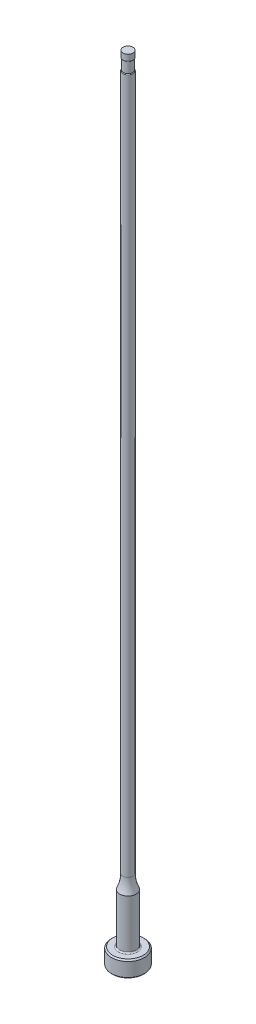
ISO-10303-21;
HEADER;
FILE_DESCRIPTION(('STEP AP214'),'2;1');
FILE_NAME('part.step','',(''),(''),'','','');
FILE_SCHEMA(('AUTOMOTIVE_DESIGN { 1 0 10303 214 1 1 1 1 }'));
ENDSEC;
DATA;
#1=APPLICATION_CONTEXT('core data for automotive mechanical design processes');
#2=APPLICATION_PROTOCOL_DEFINITION('international standard','automotive_design',2000,#1);
#3=PRODUCT_CONTEXT('',#1,'mechanical');
#4=PRODUCT('Part','Part','',(#3));
#5=PRODUCT_RELATED_PRODUCT_CATEGORY('part','',(#4));
#6=PRODUCT_DEFINITION_FORMATION('','',#4);
#7=PRODUCT_DEFINITION_CONTEXT('part definition',#1,'design');
#8=PRODUCT_DEFINITION('design','',#6,#7);
#9=PRODUCT_DEFINITION_SHAPE('','',#8);
#10=(LENGTH_UNIT() NAMED_UNIT(*) SI_UNIT(.MILLI.,.METRE.));
#11=(NAMED_UNIT(*) PLANE_ANGLE_UNIT() SI_UNIT($,.RADIAN.));
#12=(NAMED_UNIT(*) SI_UNIT($,.STERADIAN.) SOLID_ANGLE_UNIT());
#13=UNCERTAINTY_MEASURE_WITH_UNIT(LENGTH_MEASURE(1.E-05),#10,'distance_accuracy_value','');
#14=(GEOMETRIC_REPRESENTATION_CONTEXT(3) GLOBAL_UNCERTAINTY_ASSIGNED_CONTEXT((#13)) GLOBAL_UNIT_ASSIGNED_CONTEXT((#10,
#11,#12)) REPRESENTATION_CONTEXT('',''));
#15=CARTESIAN_POINT('',(0.,0.,0.));
#16=DIRECTION('',(0.,0.,1.));
#17=DIRECTION('',(1.,0.,0.));
#18=AXIS2_PLACEMENT_3D('',#15,#16,#17);
#19=CARTESIAN_POINT('',(0.,259.958771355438,0.));
#20=DIRECTION('',(0.,1.,0.));
#21=DIRECTION('',(0.,0.,1.));
#22=AXIS2_PLACEMENT_3D('',#19,#20,#21);
#23=CYLINDRICAL_SURFACE('',#22,0.991869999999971);
#24=DIRECTION('',(0.,1.,0.));
#25=VECTOR('',#24,1.);
#26=CARTESIAN_POINT('',(-0.890269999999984,259.958771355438,-0.437293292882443));
#27=LINE('',#26,#25);
#28=CARTESIAN_POINT('',(-0.890269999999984,148.973565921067,-0.437293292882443));
#29=VERTEX_POINT('',#28);
#30=CARTESIAN_POINT('',(-0.890269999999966,112.014,-0.43729329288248));
#31=VERTEX_POINT('',#30);
#32=EDGE_CURVE('E66',#29,#31,#27,.F.);
#33=ORIENTED_EDGE('',*,*,#32,.F.);
#34=CARTESIAN_POINT('',(0.,148.973565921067,0.));
#35=DIRECTION('',(0.,1.,0.));
#36=DIRECTION('',(0.,0.,1.));
#37=AXIS2_PLACEMENT_3D('',#34,#35,#36);
#38=CIRCLE('',#37,0.991869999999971);
#39=CARTESIAN_POINT('',(-0.890269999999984,148.973565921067,0.437293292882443));
#40=VERTEX_POINT('',#39);
#41=EDGE_CURVE('E44',#29,#40,#38,.F.);
#42=ORIENTED_EDGE('',*,*,#41,.T.);
#43=DIRECTION('',(0.,1.,0.));
#44=VECTOR('',#43,1.);
#45=CARTESIAN_POINT('',(-0.890269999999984,259.958771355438,0.437293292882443));
#46=LINE('',#45,#44);
#47=CARTESIAN_POINT('',(-0.890269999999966,112.014,0.43729329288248));
#48=VERTEX_POINT('',#47);
#49=EDGE_CURVE('E72',#48,#40,#46,.T.);
#50=ORIENTED_EDGE('',*,*,#49,.F.);
#51=CARTESIAN_POINT('',(-0.890269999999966,112.014,-0.437293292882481));
#52=CARTESIAN_POINT('',(-0.890266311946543,111.980545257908,-0.437278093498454));
#53=CARTESIAN_POINT('',(-0.890798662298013,111.947083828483,-0.436215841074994));
#54=CARTESIAN_POINT('',(-0.89291221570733,111.8802670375,-0.431885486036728));
#55=CARTESIAN_POINT('',(-0.894495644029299,111.846912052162,-0.428612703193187));
#56=CARTESIAN_POINT('',(-0.898710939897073,111.780207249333,-0.419700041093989));
#57=CARTESIAN_POINT('',(-0.901354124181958,111.7468615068,-0.414034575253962));
#58=CARTESIAN_POINT('',(-0.907624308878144,111.680839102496,-0.400103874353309));
#59=CARTESIAN_POINT('',(-0.911250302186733,111.648161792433,-0.391841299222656));
#60=CARTESIAN_POINT('',(-0.919626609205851,111.581872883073,-0.371778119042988));
#61=CARTESIAN_POINT('',(-0.924431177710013,111.54832221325,-0.359795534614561));
#62=CARTESIAN_POINT('',(-0.934806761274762,111.48304822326,-0.331911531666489));
#63=CARTESIAN_POINT('',(-0.940375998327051,111.451320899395,-0.316019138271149));
#64=CARTESIAN_POINT('',(-0.950464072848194,111.398247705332,-0.283956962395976));
#65=CARTESIAN_POINT('',(-0.954903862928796,111.376269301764,-0.268819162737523));
#66=CARTESIAN_POINT('',(-0.963691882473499,111.334821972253,-0.235377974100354));
#67=CARTESIAN_POINT('',(-0.968040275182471,111.315348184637,-0.217080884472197));
#68=CARTESIAN_POINT('',(-0.974794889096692,111.286172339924,-0.183749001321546));
#69=CARTESIAN_POINT('',(-0.977361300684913,111.275390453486,-0.169697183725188));
#70=CARTESIAN_POINT('',(-0.982046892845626,111.256069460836,-0.140050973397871));
#71=CARTESIAN_POINT('',(-0.98416667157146,111.247527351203,-0.124458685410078));
#72=CARTESIAN_POINT('',(-0.987438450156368,111.234502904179,-0.0946420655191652));
#73=CARTESIAN_POINT('',(-0.988692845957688,111.229581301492,-0.080622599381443));
#74=CARTESIAN_POINT('',(-0.990613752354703,111.222085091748,-0.0519284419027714));
#75=CARTESIAN_POINT('',(-0.991280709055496,111.219508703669,-0.0372542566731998));
#76=CARTESIAN_POINT('',(-0.991951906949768,111.21691599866,-0.00760975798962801));
#77=CARTESIAN_POINT('',(-0.99195380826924,111.216908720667,0.00736141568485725));
#78=CARTESIAN_POINT('',(-0.991288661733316,111.219477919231,0.0370648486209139));
#79=CARTESIAN_POINT('',(-0.99062142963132,111.222055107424,0.0517970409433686));
#80=CARTESIAN_POINT('',(-0.988743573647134,111.229383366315,0.0798806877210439));
#81=CARTESIAN_POINT('',(-0.987561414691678,111.234020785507,0.0932643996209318));
#82=CARTESIAN_POINT('',(-0.984768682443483,111.245124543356,0.119193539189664));
#83=CARTESIAN_POINT('',(-0.983157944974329,111.251591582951,0.131738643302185));
#84=CARTESIAN_POINT('',(-0.97866177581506,111.269953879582,0.162424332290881));
#85=CARTESIAN_POINT('',(-0.975558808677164,111.282890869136,0.179909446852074));
#86=CARTESIAN_POINT('',(-0.968967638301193,111.31132520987,0.212571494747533));
#87=CARTESIAN_POINT('',(-0.965478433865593,111.326829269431,0.227742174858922));
#88=CARTESIAN_POINT('',(-0.956293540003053,111.369332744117,0.264288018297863));
#89=CARTESIAN_POINT('',(-0.950512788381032,111.397709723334,0.284029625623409));
#90=CARTESIAN_POINT('',(-0.939335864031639,111.457144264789,0.319042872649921));
#91=CARTESIAN_POINT('',(-0.933940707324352,111.488208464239,0.334303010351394));
#92=CARTESIAN_POINT('',(-0.920397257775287,111.574246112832,0.370513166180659));
#93=CARTESIAN_POINT('',(-0.91295453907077,111.630778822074,0.388004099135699));
#94=CARTESIAN_POINT('',(-0.901068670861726,111.745979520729,0.414830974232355));
#95=CARTESIAN_POINT('',(-0.896628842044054,111.804649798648,0.424157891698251));
#96=CARTESIAN_POINT('',(-0.892643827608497,111.888710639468,0.432432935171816));
#97=CARTESIAN_POINT('',(-0.891752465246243,111.913788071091,0.434264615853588));
#98=CARTESIAN_POINT('',(-0.890566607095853,111.963908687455,0.436690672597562));
#99=CARTESIAN_POINT('',(-0.890269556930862,111.988951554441,0.437290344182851));
#100=CARTESIAN_POINT('',(-0.890269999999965,112.014,0.437293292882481));
#101=B_SPLINE_CURVE_WITH_KNOTS('',3,(#51,#52,#53,#54,#55,#56,#57,#58,#59,#60,#61,#62,#63,#64,
#65,#66,#67,#68,#69,#70,#71,#72,#73,#74,#75,#76,#77,#78,#79,#80,#81,#82,#83,#84,#85,#86,#87,#88,
#89,#90,#91,#92,#93,#94,#95,#96,#97,#98,#99,#100),.UNSPECIFIED.,.F.,.F.,(4,2,2,2,2,2,2,2,2,2,2,
2,2,2,2,2,2,2,2,2,2,2,2,2,4),(0.,0.10035396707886,0.200921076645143,0.302591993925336,
0.404159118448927,0.511798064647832,0.619190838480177,0.700138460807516,0.780926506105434,
0.834449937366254,0.887901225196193,0.932447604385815,0.976960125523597,1.02162925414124,
1.06631068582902,1.10878536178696,1.15127633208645,1.21681290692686,1.28252352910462,
1.38707795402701,1.49189842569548,1.66985552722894,1.84800909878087,1.92345875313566,
1.99858341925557),.UNSPECIFIED.);
#102=EDGE_CURVE('E74',#31,#48,#101,.T.);
#103=ORIENTED_EDGE('',*,*,#102,.F.);
#104=EDGE_LOOP('',(#33,#42,#50,#103));
#105=FACE_BOUND('',#104,.T.);
#106=CARTESIAN_POINT('',(0.,15.3850932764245,0.));
#107=DIRECTION('',(0.,1.,0.));
#108=DIRECTION('',(0.,0.,1.));
#109=AXIS2_PLACEMENT_3D('',#106,#107,#108);
#110=CIRCLE('',#109,0.991869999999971);
#111=CARTESIAN_POINT('',(0.,15.3850932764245,0.991869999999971));
#112=VERTEX_POINT('',#111);
#113=EDGE_CURVE('E95',#112,#112,#110,.T.);
#114=ORIENTED_EDGE('',*,*,#113,.T.);
#115=EDGE_LOOP('',(#114));
#116=FACE_BOUND('',#115,.T.);
#117=ADVANCED_FACE('F36',(#105,#116),#23,.T.);
#118=CARTESIAN_POINT('',(0.,15.3850932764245,0.));
#119=DIRECTION('',(0.,1.,0.));
#120=DIRECTION('',(0.,0.,1.));
#121=AXIS2_PLACEMENT_3D('',#118,#119,#120);
#122=TOROIDAL_SURFACE('',#121,7.34186999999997,6.35);
#123=CARTESIAN_POINT('',(0.,12.7,0.));
#124=DIRECTION('',(0.,1.,0.));
#125=DIRECTION('',(0.,0.,1.));
#126=AXIS2_PLACEMENT_3D('',#123,#124,#125);
#127=CIRCLE('',#126,1.58749999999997);
#128=CARTESIAN_POINT('',(0.,12.7,1.58749999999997));
#129=VERTEX_POINT('',#128);
#130=EDGE_CURVE('E92',#129,#129,#127,.T.);
#131=ORIENTED_EDGE('',*,*,#130,.T.);
#132=EDGE_LOOP('',(#131));
#133=FACE_BOUND('',#132,.T.);
#134=ORIENTED_EDGE('',*,*,#113,.F.);
#135=EDGE_LOOP('',(#134));
#136=FACE_BOUND('',#135,.T.);
#137=ADVANCED_FACE('F156',(#133,#136),#122,.F.);
#138=CARTESIAN_POINT('',(0.,259.958771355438,0.));
#139=DIRECTION('',(0.,1.,0.));
#140=DIRECTION('',(0.,0.,1.));
#141=AXIS2_PLACEMENT_3D('',#138,#139,#140);
#142=CYLINDRICAL_SURFACE('',#141,1.58749999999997);
#143=CARTESIAN_POINT('',(0.,3.42900000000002,0.));
#144=DIRECTION('',(0.,1.,0.));
#145=DIRECTION('',(0.,0.,1.));
#146=AXIS2_PLACEMENT_3D('',#143,#144,#145);
#147=CIRCLE('',#146,1.58749999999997);
#148=CARTESIAN_POINT('',(0.,3.42900000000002,1.58749999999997));
#149=VERTEX_POINT('',#148);
#150=EDGE_CURVE('E110',#149,#149,#147,.T.);
#151=ORIENTED_EDGE('',*,*,#150,.T.);
#152=EDGE_LOOP('',(#151));
#153=FACE_BOUND('',#152,.T.);
#154=ORIENTED_EDGE('',*,*,#130,.F.);
#155=EDGE_LOOP('',(#154));
#156=FACE_BOUND('',#155,.T.);
#157=ADVANCED_FACE('F153',(#153,#156),#142,.T.);
#158=CARTESIAN_POINT('',(-3.17499999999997,3.175,0.));
#159=DIRECTION('',(0.,1.,0.));
#160=DIRECTION('',(0.,0.,1.));
#161=AXIS2_PLACEMENT_3D('',#158,#159,#160);
#162=PLANE('',#161);
#163=CARTESIAN_POINT('',(0.,3.175,0.));
#164=DIRECTION('',(0.,1.,0.));
#165=DIRECTION('',(0.,0.,1.));
#166=AXIS2_PLACEMENT_3D('',#163,#164,#165);
#167=CIRCLE('',#166,1.84149999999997);
#168=CARTESIAN_POINT('',(0.,3.175,1.84149999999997));
#169=VERTEX_POINT('',#168);
#170=EDGE_CURVE('E78',#169,#169,#167,.F.);
#171=ORIENTED_EDGE('',*,*,#170,.T.);
#172=EDGE_LOOP('',(#171));
#173=FACE_BOUND('',#172,.T.);
#174=CARTESIAN_POINT('',(0.,3.175,0.));
#175=DIRECTION('',(0.,1.,0.));
#176=DIRECTION('',(0.,0.,1.));
#177=AXIS2_PLACEMENT_3D('',#174,#175,#176);
#178=CIRCLE('',#177,2.92099999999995);
#179=CARTESIAN_POINT('',(0.,3.175,2.92099999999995));
#180=VERTEX_POINT('',#179);
#181=EDGE_CURVE('E98',#180,#180,#178,.T.);
#182=ORIENTED_EDGE('',*,*,#181,.T.);
#183=EDGE_LOOP('',(#182));
#184=FACE_BOUND('',#183,.T.);
#185=ADVANCED_FACE('F149',(#173,#184),#162,.T.);
#186=CARTESIAN_POINT('',(0.,259.958771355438,0.));
#187=DIRECTION('',(0.,1.,0.));
#188=DIRECTION('',(0.,0.,1.));
#189=AXIS2_PLACEMENT_3D('',#186,#187,#188);
#190=CYLINDRICAL_SURFACE('',#189,3.17499999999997);
#191=CARTESIAN_POINT('',(0.,2.92100000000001,0.));
#192=DIRECTION('',(0.,1.,0.));
#193=DIRECTION('',(0.,0.,1.));
#194=AXIS2_PLACEMENT_3D('',#191,#192,#193);
#195=CIRCLE('',#194,3.17499999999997);
#196=CARTESIAN_POINT('',(0.,2.92100000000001,3.17499999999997));
#197=VERTEX_POINT('',#196);
#198=EDGE_CURVE('E104',#197,#197,#195,.F.);
#199=ORIENTED_EDGE('',*,*,#198,.T.);
#200=EDGE_LOOP('',(#199));
#201=FACE_BOUND('',#200,.T.);
#202=CARTESIAN_POINT('',(0.,0.254000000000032,0.));
#203=DIRECTION('',(0.,-1.,0.));
#204=DIRECTION('',(0.,0.,-1.));
#205=AXIS2_PLACEMENT_3D('',#202,#203,#204);
#206=CIRCLE('',#205,3.17499999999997);
#207=CARTESIAN_POINT('',(0.,0.254000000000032,-3.17499999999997));
#208=VERTEX_POINT('',#207);
#209=EDGE_CURVE('E101',#208,#208,#206,.F.);
#210=ORIENTED_EDGE('',*,*,#209,.T.);
#211=EDGE_LOOP('',(#210));
#212=FACE_BOUND('',#211,.T.);
#213=ADVANCED_FACE('F145',(#201,#212),#190,.T.);
#214=CARTESIAN_POINT('',(0.,0.,0.));
#215=DIRECTION('',(0.,-1.,0.));
#216=DIRECTION('',(0.,0.,-1.));
#217=AXIS2_PLACEMENT_3D('',#214,#215,#216);
#218=PLANE('',#217);
#219=CARTESIAN_POINT('',(0.,0.,0.));
#220=DIRECTION('',(0.,-1.,0.));
#221=DIRECTION('',(0.,0.,-1.));
#222=AXIS2_PLACEMENT_3D('',#219,#220,#221);
#223=CIRCLE('',#222,2.92099999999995);
#224=CARTESIAN_POINT('',(0.,0.,-2.92099999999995));
#225=VERTEX_POINT('',#224);
#226=EDGE_CURVE('E107',#225,#225,#223,.T.);
#227=ORIENTED_EDGE('',*,*,#226,.T.);
#228=EDGE_LOOP('',(#227));
#229=FACE_BOUND('',#228,.T.);
#230=ADVANCED_FACE('F141',(#229),#218,.T.);
#231=CARTESIAN_POINT('',(0.,3.17499999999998,0.));
#232=DIRECTION('',(0.,-1.,0.));
#233=DIRECTION('',(0.,0.,-1.));
#234=AXIS2_PLACEMENT_3D('',#231,#232,#233);
#235=CONICAL_SURFACE('',#234,2.92099999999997,0.7853981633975);
#236=ORIENTED_EDGE('',*,*,#198,.F.);
#237=EDGE_LOOP('',(#236));
#238=FACE_BOUND('',#237,.T.);
#239=ORIENTED_EDGE('',*,*,#181,.F.);
#240=EDGE_LOOP('',(#239));
#241=FACE_BOUND('',#240,.T.);
#242=ADVANCED_FACE('F144',(#238,#241),#235,.T.);
#243=CARTESIAN_POINT('',(0.,0.254000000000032,0.));
#244=DIRECTION('',(0.,1.,0.));
#245=DIRECTION('',(0.,0.,1.));
#246=AXIS2_PLACEMENT_3D('',#243,#244,#245);
#247=CONICAL_SURFACE('',#246,3.17499999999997,0.785398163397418);
#248=ORIENTED_EDGE('',*,*,#226,.F.);
#249=EDGE_LOOP('',(#248));
#250=FACE_BOUND('',#249,.T.);
#251=ORIENTED_EDGE('',*,*,#209,.F.);
#252=EDGE_LOOP('',(#251));
#253=FACE_BOUND('',#252,.T.);
#254=ADVANCED_FACE('F245',(#250,#253),#247,.T.);
#255=CARTESIAN_POINT('',(0.,3.42900000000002,0.));
#256=DIRECTION('',(0.,1.,0.));
#257=DIRECTION('',(0.,0.,1.));
#258=AXIS2_PLACEMENT_3D('',#255,#256,#257);
#259=TOROIDAL_SURFACE('',#258,1.84149999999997,0.254);
#260=ORIENTED_EDGE('',*,*,#170,.F.);
#261=EDGE_LOOP('',(#260));
#262=FACE_BOUND('',#261,.T.);
#263=ORIENTED_EDGE('',*,*,#150,.F.);
#264=EDGE_LOOP('',(#263));
#265=FACE_BOUND('',#264,.T.);
#266=ADVANCED_FACE('F139',(#262,#265),#259,.F.);
#267=CARTESIAN_POINT('',(0.,153.448281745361,0.));
#268=DIRECTION('',(0.,1.,0.));
#269=DIRECTION('',(0.,0.,1.));
#270=AXIS2_PLACEMENT_3D('',#267,#268,#269);
#271=CYLINDRICAL_SURFACE('',#270,0.890269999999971);
#272=CARTESIAN_POINT('',(0.,151.13,0.));
#273=DIRECTION('',(0.,1.,0.));
#274=DIRECTION('',(0.,0.,1.));
#275=AXIS2_PLACEMENT_3D('',#272,#273,#274);
#276=CIRCLE('',#275,0.890269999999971);
#277=CARTESIAN_POINT('',(0.,151.13,0.890269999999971));
#278=VERTEX_POINT('',#277);
#279=EDGE_CURVE('E71',#278,#278,#276,.T.);
#280=ORIENTED_EDGE('',*,*,#279,.F.);
#281=EDGE_LOOP('',(#280));
#282=FACE_BOUND('',#281,.T.);
#283=CARTESIAN_POINT('',(0.,149.098,0.));
#284=DIRECTION('',(0.,1.,0.));
#285=DIRECTION('',(0.,0.,1.));
#286=AXIS2_PLACEMENT_3D('',#283,#284,#285);
#287=CIRCLE('',#286,0.89026999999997);
#288=CARTESIAN_POINT('',(-0.890269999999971,149.098,0.));
#289=VERTEX_POINT('',#288);
#290=EDGE_CURVE('E89',#289,#289,#287,.T.);
#291=ORIENTED_EDGE('',*,*,#290,.T.);
#292=EDGE_LOOP('',(#291));
#293=FACE_BOUND('',#292,.T.);
#294=ADVANCED_FACE('F136',(#282,#293),#271,.T.);
#295=CARTESIAN_POINT('',(-0.890269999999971,150.114,-3.17499999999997));
#296=DIRECTION('',(1.,0.,0.));
#297=DIRECTION('',(0.,1.,0.));
#298=AXIS2_PLACEMENT_3D('',#295,#296,#297);
#299=PLANE('',#298);
#300=CARTESIAN_POINT('',(-0.890269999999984,148.973565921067,0.437293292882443));
#301=CARTESIAN_POINT('',(-0.890269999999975,148.976968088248,0.437301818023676));
#302=CARTESIAN_POINT('',(-0.890269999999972,148.980360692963,0.436983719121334));
#303=CARTESIAN_POINT('',(-0.890269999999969,148.987009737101,0.43576958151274));
#304=CARTESIAN_POINT('',(-0.89026999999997,148.990267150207,0.434878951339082));
#305=CARTESIAN_POINT('',(-0.890269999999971,148.996585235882,0.43259622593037));
#306=CARTESIAN_POINT('',(-0.890269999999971,148.999646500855,0.431205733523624));
#307=CARTESIAN_POINT('',(-0.89026999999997,149.005552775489,0.428014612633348));
#308=CARTESIAN_POINT('',(-0.89026999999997,149.008397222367,0.426212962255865));
#309=CARTESIAN_POINT('',(-0.89026999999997,149.015805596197,0.420882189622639));
#310=CARTESIAN_POINT('',(-0.89026999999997,149.02014344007,0.417039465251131));
#311=CARTESIAN_POINT('',(-0.89026999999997,149.028182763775,0.408741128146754));
#312=CARTESIAN_POINT('',(-0.89026999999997,149.031882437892,0.404283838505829));
#313=CARTESIAN_POINT('',(-0.89026999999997,149.0415289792,0.391183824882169));
#314=CARTESIAN_POINT('',(-0.89026999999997,149.046853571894,0.382087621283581));
#315=CARTESIAN_POINT('',(-0.89026999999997,149.056198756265,0.363263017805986));
#316=CARTESIAN_POINT('',(-0.89026999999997,149.060215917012,0.353533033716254));
#317=CARTESIAN_POINT('',(-0.89026999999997,149.069122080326,0.32859875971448));
#318=CARTESIAN_POINT('',(-0.89026999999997,149.07338200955,0.313173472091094));
#319=CARTESIAN_POINT('',(-0.89026999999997,149.080438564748,0.281981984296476));
#320=CARTESIAN_POINT('',(-0.89026999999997,149.083231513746,0.266215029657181));
#321=CARTESIAN_POINT('',(-0.89026999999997,149.090162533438,0.218503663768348));
#322=CARTESIAN_POINT('',(-0.89026999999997,149.092797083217,0.186351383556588));
#323=CARTESIAN_POINT('',(-0.89026999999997,149.095945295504,0.128280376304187));
#324=CARTESIAN_POINT('',(-0.89026999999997,149.09677238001,0.102368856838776));
#325=CARTESIAN_POINT('',(-0.89026999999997,149.097538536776,0.0637070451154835));
#326=CARTESIAN_POINT('',(-0.89026999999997,149.097715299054,0.0509633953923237));
#327=CARTESIAN_POINT('',(-0.89026999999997,149.097944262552,0.0254795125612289));
#328=CARTESIAN_POINT('',(-0.89026999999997,149.097996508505,0.012739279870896));
#329=CARTESIAN_POINT('',(-0.89026999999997,149.098000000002,1.16241362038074E-13));
#330=B_SPLINE_CURVE_WITH_KNOTS('',3,(#300,#301,#302,#303,#304,#305,#306,#307,#308,#309,#310,
#311,#312,#313,#314,#315,#316,#317,#318,#319,#320,#321,#322,#323,#324,#325,#326,#327,#328,#329),
.UNSPECIFIED.,.F.,.F.,(4,2,2,2,2,2,2,2,2,2,2,2,2,2,4),(0.,0.010176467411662,0.0202581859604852,
0.030307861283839,0.0403827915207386,0.0576671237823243,0.0749995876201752,0.106441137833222,
0.137964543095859,0.185843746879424,0.233842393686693,0.330464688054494,0.408243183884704,
0.446476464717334,0.484696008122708),.UNSPECIFIED.);
#331=EDGE_CURVE('E77',#40,#289,#330,.T.);
#332=ORIENTED_EDGE('',*,*,#331,.T.);
#333=CARTESIAN_POINT('',(-0.89026999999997,149.098,0.));
#334=CARTESIAN_POINT('',(-0.89026999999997,149.097969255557,-0.0211447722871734));
#335=CARTESIAN_POINT('',(-0.89026999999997,149.097844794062,-0.0422938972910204));
#336=CARTESIAN_POINT('',(-0.89026999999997,149.097189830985,-0.0846467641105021));
#337=CARTESIAN_POINT('',(-0.89026999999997,149.096658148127,-0.105850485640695));
#338=CARTESIAN_POINT('',(-0.89026999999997,149.094965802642,-0.148284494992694));
#339=CARTESIAN_POINT('',(-0.89026999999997,149.09380367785,-0.16951472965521));
#340=CARTESIAN_POINT('',(-0.89026999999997,149.090394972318,-0.211874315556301));
#341=CARTESIAN_POINT('',(-0.89026999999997,149.088149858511,-0.233003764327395));
#342=CARTESIAN_POINT('',(-0.89026999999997,149.083358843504,-0.264920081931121));
#343=CARTESIAN_POINT('',(-0.89026999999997,149.081474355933,-0.275804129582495));
#344=CARTESIAN_POINT('',(-0.89026999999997,149.077051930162,-0.297473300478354));
#345=CARTESIAN_POINT('',(-0.89026999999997,149.074512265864,-0.308258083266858));
#346=CARTESIAN_POINT('',(-0.89026999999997,149.068067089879,-0.331438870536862));
#347=CARTESIAN_POINT('',(-0.89026999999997,149.064001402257,-0.343791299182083));
#348=CARTESIAN_POINT('',(-0.89026999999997,149.054220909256,-0.367815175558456));
#349=CARTESIAN_POINT('',(-0.89026999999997,149.048514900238,-0.379489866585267));
#350=CARTESIAN_POINT('',(-0.89026999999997,149.038928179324,-0.394623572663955));
#351=CARTESIAN_POINT('',(-0.89026999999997,149.036075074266,-0.398729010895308));
#352=CARTESIAN_POINT('',(-0.89026999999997,149.029937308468,-0.406618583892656));
#353=CARTESIAN_POINT('',(-0.89026999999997,149.02665209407,-0.410402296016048));
#354=CARTESIAN_POINT('',(-0.89026999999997,149.019554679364,-0.417536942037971));
#355=CARTESIAN_POINT('',(-0.89026999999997,149.015736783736,-0.420882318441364));
#356=CARTESIAN_POINT('',(-0.89026999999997,149.007570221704,-0.426851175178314));
#357=CARTESIAN_POINT('',(-0.89026999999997,149.003223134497,-0.429476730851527));
#358=CARTESIAN_POINT('',(-0.89026999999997,148.995577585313,-0.433007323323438));
#359=CARTESIAN_POINT('',(-0.89026999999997,148.992409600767,-0.43419417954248));
#360=CARTESIAN_POINT('',(-0.89026999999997,148.985923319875,-0.43602039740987));
#361=CARTESIAN_POINT('',(-0.89026999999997,148.982605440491,-0.436661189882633));
#362=CARTESIAN_POINT('',(-0.89026999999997,148.97736752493,-0.437197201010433));
#363=CARTESIAN_POINT('',(-0.89026999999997,148.975466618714,-0.437295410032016));
#364=CARTESIAN_POINT('',(-0.89026999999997,148.973565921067,-0.437293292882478));
#365=B_SPLINE_CURVE_WITH_KNOTS('',3,(#333,#334,#335,#336,#337,#338,#339,#340,#341,#342,#343,
#344,#345,#346,#347,#348,#349,#350,#351,#352,#353,#354,#355,#356,#357,#358,#359,#360,#361,#362,
#363,#364),.UNSPECIFIED.,.F.,.F.,(4,2,2,2,2,2,2,2,2,2,2,2,2,2,2,4),(0.,0.0634413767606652,
0.127067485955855,0.19084179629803,0.254529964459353,0.287653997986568,0.32086620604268,
0.359816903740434,0.398562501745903,0.413539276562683,0.428535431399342,0.443706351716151,
0.4588330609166,0.468942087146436,0.479024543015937,0.484725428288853),.UNSPECIFIED.);
#366=EDGE_CURVE('E58',#289,#29,#365,.T.);
#367=ORIENTED_EDGE('',*,*,#366,.T.);
#368=ORIENTED_EDGE('',*,*,#32,.T.);
#369=DIRECTION('',(0.,0.,1.));
#370=VECTOR('',#369,1.);
#371=CARTESIAN_POINT('',(-0.890269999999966,112.014,-3.17499999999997));
#372=LINE('',#371,#370);
#373=EDGE_CURVE('E70',#31,#48,#372,.T.);
#374=ORIENTED_EDGE('',*,*,#373,.T.);
#375=ORIENTED_EDGE('',*,*,#49,.T.);
#376=EDGE_LOOP('',(#332,#367,#368,#374,#375));
#377=FACE_BOUND('',#376,.T.);
#378=ADVANCED_FACE('F68',(#377),#299,.F.);
#379=CARTESIAN_POINT('',(-4.06526999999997,112.014,-3.17499999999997));
#380=DIRECTION('',(0.,0.,1.));
#381=DIRECTION('',(1.,0.,0.));
#382=AXIS2_PLACEMENT_3D('',#379,#380,#381);
#383=CYLINDRICAL_SURFACE('',#382,3.175);
#384=ORIENTED_EDGE('',*,*,#373,.F.);
#385=ORIENTED_EDGE('',*,*,#102,.T.);
#386=EDGE_LOOP('',(#384,#385));
#387=FACE_BOUND('',#386,.T.);
#388=ADVANCED_FACE('F80',(#387),#383,.F.);
#389=CARTESIAN_POINT('',(0.,152.687735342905,0.));
#390=DIRECTION('',(0.,1.,0.));
#391=DIRECTION('',(0.,0.,1.));
#392=AXIS2_PLACEMENT_3D('',#389,#390,#391);
#393=CYLINDRICAL_SURFACE('',#392,0.972819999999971);
#394=CARTESIAN_POINT('',(0.,151.24896721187,0.));
#395=DIRECTION('',(0.,-1.,0.));
#396=DIRECTION('',(0.,0.,-1.));
#397=AXIS2_PLACEMENT_3D('',#394,#395,#396);
#398=CIRCLE('',#397,0.972819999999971);
#399=CARTESIAN_POINT('',(0.,151.24896721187,-0.972819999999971));
#400=VERTEX_POINT('',#399);
#401=EDGE_CURVE('E11',#400,#400,#398,.F.);
#402=ORIENTED_EDGE('',*,*,#401,.T.);
#403=EDGE_LOOP('',(#402));
#404=FACE_BOUND('',#403,.T.);
#405=CARTESIAN_POINT('',(0.,152.4,0.));
#406=DIRECTION('',(0.,1.,0.));
#407=DIRECTION('',(0.,0.,1.));
#408=AXIS2_PLACEMENT_3D('',#405,#406,#407);
#409=CIRCLE('',#408,0.972819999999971);
#410=CARTESIAN_POINT('',(0.,152.4,0.972819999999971));
#411=VERTEX_POINT('',#410);
#412=EDGE_CURVE('E81',#411,#411,#409,.T.);
#413=ORIENTED_EDGE('',*,*,#412,.F.);
#414=EDGE_LOOP('',(#413));
#415=FACE_BOUND('',#414,.T.);
#416=ADVANCED_FACE('F133',(#404,#415),#393,.T.);
#417=CARTESIAN_POINT('',(-0.99186999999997,152.4,0.));
#418=DIRECTION('',(0.,1.,0.));
#419=DIRECTION('',(0.,0.,1.));
#420=AXIS2_PLACEMENT_3D('',#417,#418,#419);
#421=PLANE('',#420);
#422=ORIENTED_EDGE('',*,*,#412,.T.);
#423=EDGE_LOOP('',(#422));
#424=FACE_BOUND('',#423,.T.);
#425=ADVANCED_FACE('F177',(#424),#421,.T.);
#426=CARTESIAN_POINT('',(0.,148.973565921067,0.));
#427=DIRECTION('',(0.,1.,0.));
#428=DIRECTION('',(0.,0.,1.));
#429=AXIS2_PLACEMENT_3D('',#426,#427,#428);
#430=TOROIDAL_SURFACE('',#429,0.864869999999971,0.127);
#431=ORIENTED_EDGE('',*,*,#331,.F.);
#432=ORIENTED_EDGE('',*,*,#41,.F.);
#433=ORIENTED_EDGE('',*,*,#366,.F.);
#434=ORIENTED_EDGE('',*,*,#290,.F.);
#435=EDGE_LOOP('',(#431,#432,#433,#434));
#436=FACE_BOUND('',#435,.T.);
#437=ADVANCED_FACE('F209',(#436),#430,.T.);
#438=CARTESIAN_POINT('',(0.,151.24896721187,0.));
#439=DIRECTION('',(0.,-1.,0.));
#440=DIRECTION('',(0.,0.,-1.));
#441=AXIS2_PLACEMENT_3D('',#438,#439,#440);
#442=TOROIDAL_SURFACE('',#441,0.845819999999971,0.127);
#443=ORIENTED_EDGE('',*,*,#279,.T.);
#444=EDGE_LOOP('',(#443));
#445=FACE_BOUND('',#444,.T.);
#446=ORIENTED_EDGE('',*,*,#401,.F.);
#447=EDGE_LOOP('',(#446));
#448=FACE_BOUND('',#447,.T.);
#449=ADVANCED_FACE('F38',(#445,#448),#442,.T.);
#450=CLOSED_SHELL('',(#117,#137,#157,#185,#213,#230,#242,#254,#266,#294,#378,#388,#416,#425,
#437,#449));
#451=MANIFOLD_SOLID_BREP('B2',#450);
#452=ADVANCED_BREP_SHAPE_REPRESENTATION('',(#18,#451),#14);
#453=SHAPE_DEFINITION_REPRESENTATION(#9,#452);
ENDSEC;
END-ISO-10303-21;
